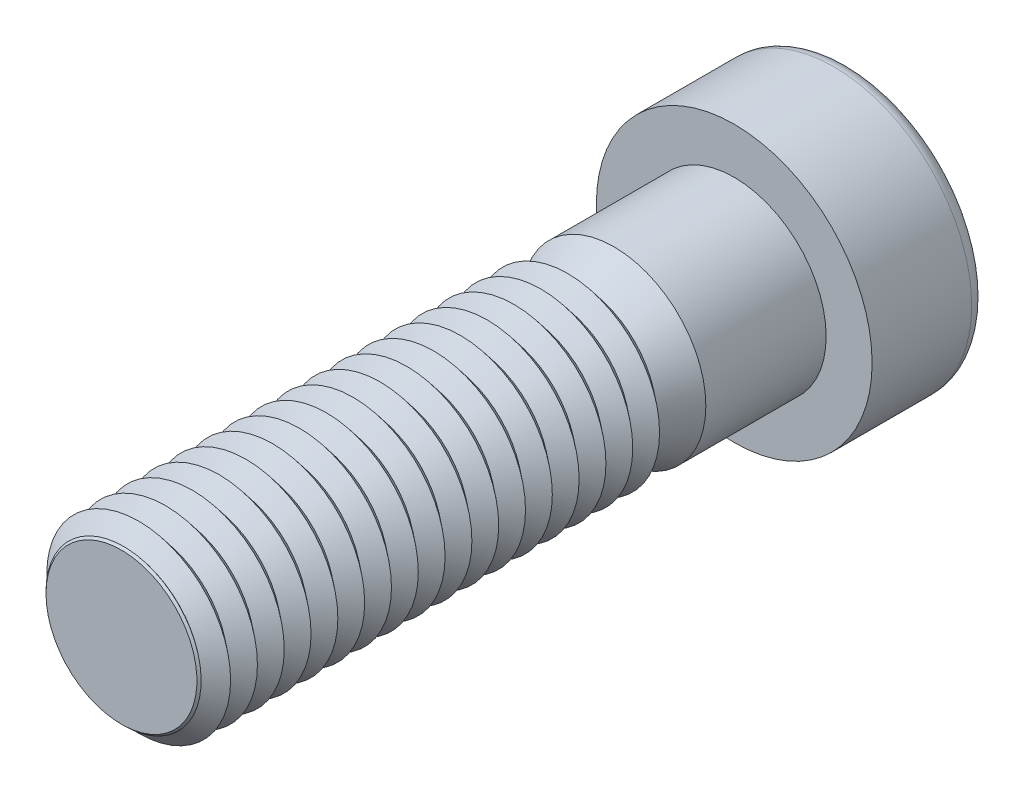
ISO-10303-21;
HEADER;
FILE_DESCRIPTION(('STEP AP214'),'2;1');
FILE_NAME('part.step','',(''),(''),'','','');
FILE_SCHEMA(('AUTOMOTIVE_DESIGN { 1 0 10303 214 1 1 1 1 }'));
ENDSEC;
DATA;
#1=APPLICATION_CONTEXT('core data for automotive mechanical design processes');
#2=APPLICATION_PROTOCOL_DEFINITION('international standard','automotive_design',2000,#1);
#3=PRODUCT_CONTEXT('',#1,'mechanical');
#4=PRODUCT('Part','Part','',(#3));
#5=PRODUCT_RELATED_PRODUCT_CATEGORY('part','',(#4));
#6=PRODUCT_DEFINITION_FORMATION('','',#4);
#7=PRODUCT_DEFINITION_CONTEXT('part definition',#1,'design');
#8=PRODUCT_DEFINITION('design','',#6,#7);
#9=PRODUCT_DEFINITION_SHAPE('','',#8);
#10=(LENGTH_UNIT() NAMED_UNIT(*) SI_UNIT(.MILLI.,.METRE.));
#11=(NAMED_UNIT(*) PLANE_ANGLE_UNIT() SI_UNIT($,.RADIAN.));
#12=(NAMED_UNIT(*) SI_UNIT($,.STERADIAN.) SOLID_ANGLE_UNIT());
#13=UNCERTAINTY_MEASURE_WITH_UNIT(LENGTH_MEASURE(1.E-05),#10,'distance_accuracy_value','');
#14=(GEOMETRIC_REPRESENTATION_CONTEXT(3) GLOBAL_UNCERTAINTY_ASSIGNED_CONTEXT((#13)) GLOBAL_UNIT_ASSIGNED_CONTEXT((#10,
#11,#12)) REPRESENTATION_CONTEXT('',''));
#15=CARTESIAN_POINT('',(0.,0.,0.));
#16=DIRECTION('',(0.,0.,1.));
#17=DIRECTION('',(1.,0.,0.));
#18=AXIS2_PLACEMENT_3D('',#15,#16,#17);
#19=CARTESIAN_POINT('',(73.9999999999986,39.9632500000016,19.9999999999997));
#20=DIRECTION('',(0.,0.,1.));
#21=DIRECTION('',(1.,0.,0.));
#22=AXIS2_PLACEMENT_3D('',#19,#20,#21);
#23=PLANE('',#22);
#24=CARTESIAN_POINT('',(73.9999999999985,37.5000000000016,20.0000000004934));
#25=DIRECTION('',(0.,0.,-1.));
#26=DIRECTION('',(-1.,0.,0.));
#27=AXIS2_PLACEMENT_3D('',#24,#25,#26);
#28=CIRCLE('',#27,4.92650000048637);
#29=CARTESIAN_POINT('',(69.0734999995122,37.5000000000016,20.0000000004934));
#30=VERTEX_POINT('',#29);
#31=EDGE_CURVE('E19',#30,#30,#28,.T.);
#32=ORIENTED_EDGE('',*,*,#31,.F.);
#33=EDGE_LOOP('',(#32));
#34=FACE_BOUND('',#33,.T.);
#35=ADVANCED_FACE('F16',(#34),#23,.T.);
#36=CARTESIAN_POINT('',(73.9999999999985,37.5000000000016,19.8622658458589));
#37=DIRECTION('',(0.,0.,-1.));
#38=DIRECTION('',(-1.,0.,0.));
#39=AXIS2_PLACEMENT_3D('',#36,#37,#38);
#40=CONICAL_SURFACE('',#39,5.06423415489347,0.785398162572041);
#41=ORIENTED_EDGE('',*,*,#31,.T.);
#42=EDGE_LOOP('',(#41));
#43=FACE_BOUND('',#42,.T.);
#44=CARTESIAN_POINT('',(73.9999999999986,37.5000000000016,19.8622658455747));
#45=DIRECTION('',(0.,0.,1.));
#46=DIRECTION('',(0.,-1.,0.));
#47=AXIS2_PLACEMENT_3D('',#44,#45,#46);
#48=CIRCLE('',#47,5.06423415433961);
#49=CARTESIAN_POINT('',(73.9999999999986,32.435765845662,19.8622658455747));
#50=VERTEX_POINT('',#49);
#51=EDGE_CURVE('E270',#50,#50,#48,.F.);
#52=ORIENTED_EDGE('',*,*,#51,.F.);
#53=EDGE_LOOP('',(#52));
#54=FACE_BOUND('',#53,.T.);
#55=ADVANCED_FACE('F759',(#43,#54),#40,.T.);
#56=CARTESIAN_POINT('',(73.9999999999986,37.5000000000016,19.862265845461));
#57=DIRECTION('',(0.,0.,1.));
#58=DIRECTION('',(1.,0.,0.));
#59=AXIS2_PLACEMENT_3D('',#56,#57,#58);
#60=CONICAL_SURFACE('',#59,5.06423415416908,0.88692115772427);
#61=CARTESIAN_POINT('',(73.9999999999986,37.5000000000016,19.7500000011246));
#62=DIRECTION('',(0.,0.,-1.));
#63=DIRECTION('',(0.,-1.,0.));
#64=AXIS2_PLACEMENT_3D('',#61,#62,#63);
#65=CIRCLE('',#64,4.92650000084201);
#66=CARTESIAN_POINT('',(73.9999999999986,32.5734999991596,19.7500000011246));
#67=VERTEX_POINT('',#66);
#68=EDGE_CURVE('E265',#67,#67,#65,.T.);
#69=ORIENTED_EDGE('',*,*,#68,.F.);
#70=EDGE_LOOP('',(#69));
#71=FACE_BOUND('',#70,.T.);
#72=ORIENTED_EDGE('',*,*,#51,.T.);
#73=EDGE_LOOP('',(#72));
#74=FACE_BOUND('',#73,.T.);
#75=ADVANCED_FACE('F751',(#71,#74),#60,.T.);
#76=CARTESIAN_POINT('',(73.9999999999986,37.5000000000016,18.87499999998));
#77=DIRECTION('',(0.,0.,-1.));
#78=DIRECTION('',(-1.,0.,0.));
#79=AXIS2_PLACEMENT_3D('',#76,#77,#78);
#80=CONICAL_SURFACE('',#79,6.00000000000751,0.886921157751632);
#81=CARTESIAN_POINT('',(73.9999999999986,37.5000000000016,18.87500000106));
#82=DIRECTION('',(0.,0.,1.));
#83=DIRECTION('',(0.,-1.,0.));
#84=AXIS2_PLACEMENT_3D('',#81,#82,#83);
#85=CIRCLE('',#84,5.99999999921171);
#86=CARTESIAN_POINT('',(73.9999999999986,31.5000000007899,18.87500000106));
#87=VERTEX_POINT('',#86);
#88=EDGE_CURVE('E260',#87,#87,#85,.F.);
#89=ORIENTED_EDGE('',*,*,#88,.F.);
#90=EDGE_LOOP('',(#89));
#91=FACE_BOUND('',#90,.T.);
#92=ORIENTED_EDGE('',*,*,#68,.T.);
#93=EDGE_LOOP('',(#92));
#94=FACE_BOUND('',#93,.T.);
#95=ADVANCED_FACE('F743',(#91,#94),#80,.T.);
#96=CARTESIAN_POINT('',(73.9999999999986,37.5000000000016,18.8750000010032));
#97=DIRECTION('',(0.,0.,1.));
#98=DIRECTION('',(0.,-1.,0.));
#99=AXIS2_PLACEMENT_3D('',#96,#97,#98);
#100=CONICAL_SURFACE('',#99,5.99999999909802,0.886921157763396);
#101=CARTESIAN_POINT('',(73.9999999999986,37.5000000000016,18.0000000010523));
#102=DIRECTION('',(0.,0.,-1.));
#103=DIRECTION('',(0.,-1.,0.));
#104=AXIS2_PLACEMENT_3D('',#101,#102,#103);
#105=CIRCLE('',#104,4.92650000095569);
#106=CARTESIAN_POINT('',(73.9999999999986,32.5734999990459,18.0000000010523));
#107=VERTEX_POINT('',#106);
#108=EDGE_CURVE('E255',#107,#107,#105,.T.);
#109=ORIENTED_EDGE('',*,*,#108,.F.);
#110=EDGE_LOOP('',(#109));
#111=FACE_BOUND('',#110,.T.);
#112=ORIENTED_EDGE('',*,*,#88,.T.);
#113=EDGE_LOOP('',(#112));
#114=FACE_BOUND('',#113,.T.);
#115=ADVANCED_FACE('F735',(#111,#114),#100,.T.);
#116=CARTESIAN_POINT('',(73.9999999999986,37.5000000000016,17.1250000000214));
#117=DIRECTION('',(0.,0.,-1.));
#118=DIRECTION('',(-1.,0.,0.));
#119=AXIS2_PLACEMENT_3D('',#116,#117,#118);
#120=CONICAL_SURFACE('',#119,6.00000000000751,0.886921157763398);
#121=CARTESIAN_POINT('',(73.9999999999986,37.5000000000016,17.1250000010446));
#122=DIRECTION('',(0.,0.,1.));
#123=DIRECTION('',(0.,-1.,0.));
#124=AXIS2_PLACEMENT_3D('',#121,#122,#123);
#125=CIRCLE('',#124,5.99999999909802);
#126=CARTESIAN_POINT('',(73.9999999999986,31.5000000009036,17.1250000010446));
#127=VERTEX_POINT('',#126);
#128=EDGE_CURVE('E250',#127,#127,#125,.F.);
#129=ORIENTED_EDGE('',*,*,#128,.F.);
#130=EDGE_LOOP('',(#129));
#131=FACE_BOUND('',#130,.T.);
#132=ORIENTED_EDGE('',*,*,#108,.T.);
#133=EDGE_LOOP('',(#132));
#134=FACE_BOUND('',#133,.T.);
#135=ADVANCED_FACE('F727',(#131,#134),#120,.T.);
#136=CARTESIAN_POINT('',(73.9999999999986,37.5000000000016,17.1250000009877));
#137=DIRECTION('',(0.,0.,1.));
#138=DIRECTION('',(0.,-1.,0.));
#139=AXIS2_PLACEMENT_3D('',#136,#137,#138);
#140=CONICAL_SURFACE('',#139,5.99999999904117,0.886921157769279);
#141=CARTESIAN_POINT('',(73.9999999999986,37.5000000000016,16.2500000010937));
#142=DIRECTION('',(0.,0.,-1.));
#143=DIRECTION('',(0.,-1.,0.));
#144=AXIS2_PLACEMENT_3D('',#141,#142,#143);
#145=CIRCLE('',#144,4.92650000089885);
#146=CARTESIAN_POINT('',(73.9999999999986,32.5734999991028,16.2500000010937));
#147=VERTEX_POINT('',#146);
#148=EDGE_CURVE('E245',#147,#147,#145,.T.);
#149=ORIENTED_EDGE('',*,*,#148,.F.);
#150=EDGE_LOOP('',(#149));
#151=FACE_BOUND('',#150,.T.);
#152=ORIENTED_EDGE('',*,*,#128,.T.);
#153=EDGE_LOOP('',(#152));
#154=FACE_BOUND('',#153,.T.);
#155=ADVANCED_FACE('F719',(#151,#154),#140,.T.);
#156=CARTESIAN_POINT('',(73.9999999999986,37.5000000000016,15.3750000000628));
#157=DIRECTION('',(0.,0.,-1.));
#158=DIRECTION('',(-1.,0.,0.));
#159=AXIS2_PLACEMENT_3D('',#156,#157,#158);
#160=CONICAL_SURFACE('',#159,5.99999999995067,0.886921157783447);
#161=CARTESIAN_POINT('',(73.9999999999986,37.5000000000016,15.3750000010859));
#162=DIRECTION('',(0.,0.,1.));
#163=DIRECTION('',(0.,-1.,0.));
#164=AXIS2_PLACEMENT_3D('',#161,#162,#163);
#165=CIRCLE('',#164,5.99999999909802);
#166=CARTESIAN_POINT('',(73.9999999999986,31.5000000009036,15.3750000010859));
#167=VERTEX_POINT('',#166);
#168=EDGE_CURVE('E240',#167,#167,#165,.F.);
#169=ORIENTED_EDGE('',*,*,#168,.F.);
#170=EDGE_LOOP('',(#169));
#171=FACE_BOUND('',#170,.T.);
#172=ORIENTED_EDGE('',*,*,#148,.T.);
#173=EDGE_LOOP('',(#172));
#174=FACE_BOUND('',#173,.T.);
#175=ADVANCED_FACE('F711',(#171,#174),#160,.T.);
#176=CARTESIAN_POINT('',(73.9999999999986,37.5000000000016,15.3750000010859));
#177=DIRECTION('',(0.,0.,1.));
#178=DIRECTION('',(1.,0.,0.));
#179=AXIS2_PLACEMENT_3D('',#176,#177,#178);
#180=CONICAL_SURFACE('',#179,5.99999999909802,0.88692115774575);
#181=CARTESIAN_POINT('',(73.9999999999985,37.5000000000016,14.500000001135));
#182=DIRECTION('',(0.,0.,-1.));
#183=DIRECTION('',(0.,-1.,0.));
#184=AXIS2_PLACEMENT_3D('',#181,#182,#183);
#185=CIRCLE('',#184,4.92650000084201);
#186=CARTESIAN_POINT('',(73.9999999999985,32.5734999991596,14.500000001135));
#187=VERTEX_POINT('',#186);
#188=EDGE_CURVE('E235',#187,#187,#185,.T.);
#189=ORIENTED_EDGE('',*,*,#188,.F.);
#190=EDGE_LOOP('',(#189));
#191=FACE_BOUND('',#190,.T.);
#192=ORIENTED_EDGE('',*,*,#168,.T.);
#193=EDGE_LOOP('',(#192));
#194=FACE_BOUND('',#193,.T.);
#195=ADVANCED_FACE('F703',(#191,#194),#180,.T.);
#196=CARTESIAN_POINT('',(73.9999999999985,37.5000000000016,13.6249999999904));
#197=DIRECTION('',(0.,0.,-1.));
#198=DIRECTION('',(0.,1.,0.));
#199=AXIS2_PLACEMENT_3D('',#196,#197,#198);
#200=CONICAL_SURFACE('',#199,6.00000000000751,0.886921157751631);
#201=CARTESIAN_POINT('',(73.9999999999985,37.5000000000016,13.6250000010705));
#202=DIRECTION('',(0.,0.,1.));
#203=DIRECTION('',(0.,-1.,0.));
#204=AXIS2_PLACEMENT_3D('',#201,#202,#203);
#205=CIRCLE('',#204,5.99999999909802);
#206=CARTESIAN_POINT('',(73.9999999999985,31.5000000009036,13.6250000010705));
#207=VERTEX_POINT('',#206);
#208=EDGE_CURVE('E230',#207,#207,#205,.F.);
#209=ORIENTED_EDGE('',*,*,#208,.F.);
#210=EDGE_LOOP('',(#209));
#211=FACE_BOUND('',#210,.T.);
#212=ORIENTED_EDGE('',*,*,#188,.T.);
#213=EDGE_LOOP('',(#212));
#214=FACE_BOUND('',#213,.T.);
#215=ADVANCED_FACE('F695',(#211,#214),#200,.T.);
#216=CARTESIAN_POINT('',(73.9999999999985,37.5000000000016,13.6250000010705));
#217=DIRECTION('',(0.,0.,1.));
#218=DIRECTION('',(1.,0.,0.));
#219=AXIS2_PLACEMENT_3D('',#216,#217,#218);
#220=CONICAL_SURFACE('',#219,5.99999999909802,0.886921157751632);
#221=CARTESIAN_POINT('',(73.9999999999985,37.5000000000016,12.7500000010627));
#222=DIRECTION('',(0.,0.,-1.));
#223=DIRECTION('',(0.,-1.,0.));
#224=AXIS2_PLACEMENT_3D('',#221,#222,#223);
#225=CIRCLE('',#224,4.92650000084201);
#226=CARTESIAN_POINT('',(73.9999999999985,32.5734999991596,12.7500000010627));
#227=VERTEX_POINT('',#226);
#228=EDGE_CURVE('E225',#227,#227,#225,.T.);
#229=ORIENTED_EDGE('',*,*,#228,.F.);
#230=EDGE_LOOP('',(#229));
#231=FACE_BOUND('',#230,.T.);
#232=ORIENTED_EDGE('',*,*,#208,.T.);
#233=EDGE_LOOP('',(#232));
#234=FACE_BOUND('',#233,.T.);
#235=ADVANCED_FACE('F687',(#231,#234),#220,.T.);
#236=CARTESIAN_POINT('',(73.9999999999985,37.5000000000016,11.8749999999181));
#237=DIRECTION('',(0.,0.,-1.));
#238=DIRECTION('',(-1.,0.,0.));
#239=AXIS2_PLACEMENT_3D('',#236,#237,#238);
#240=CONICAL_SURFACE('',#239,6.00000000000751,0.88692115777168);
#241=CARTESIAN_POINT('',(73.9999999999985,37.5000000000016,11.875000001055));
#242=DIRECTION('',(0.,0.,1.));
#243=DIRECTION('',(0.,-1.,0.));
#244=AXIS2_PLACEMENT_3D('',#241,#242,#243);
#245=CIRCLE('',#244,5.99999999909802);
#246=CARTESIAN_POINT('',(73.9999999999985,31.5000000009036,11.875000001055));
#247=VERTEX_POINT('',#246);
#248=EDGE_CURVE('E220',#247,#247,#245,.F.);
#249=ORIENTED_EDGE('',*,*,#248,.F.);
#250=EDGE_LOOP('',(#249));
#251=FACE_BOUND('',#250,.T.);
#252=ORIENTED_EDGE('',*,*,#228,.T.);
#253=EDGE_LOOP('',(#252));
#254=FACE_BOUND('',#253,.T.);
#255=ADVANCED_FACE('F679',(#251,#254),#240,.T.);
#256=CARTESIAN_POINT('',(73.9999999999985,37.5000000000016,11.8750000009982));
#257=DIRECTION('',(0.,0.,1.));
#258=DIRECTION('',(1.,0.,0.));
#259=AXIS2_PLACEMENT_3D('',#256,#257,#258);
#260=CONICAL_SURFACE('',#259,5.99999999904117,0.886921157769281);
#261=CARTESIAN_POINT('',(73.9999999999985,37.5000000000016,11.0000000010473));
#262=DIRECTION('',(0.,0.,-1.));
#263=DIRECTION('',(0.,-1.,0.));
#264=AXIS2_PLACEMENT_3D('',#261,#262,#263);
#265=CIRCLE('',#264,4.92650000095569);
#266=CARTESIAN_POINT('',(73.9999999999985,32.5734999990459,11.0000000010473));
#267=VERTEX_POINT('',#266);
#268=EDGE_CURVE('E215',#267,#267,#265,.T.);
#269=ORIENTED_EDGE('',*,*,#268,.F.);
#270=EDGE_LOOP('',(#269));
#271=FACE_BOUND('',#270,.T.);
#272=ORIENTED_EDGE('',*,*,#248,.T.);
#273=EDGE_LOOP('',(#272));
#274=FACE_BOUND('',#273,.T.);
#275=ADVANCED_FACE('F671',(#271,#274),#260,.T.);
#276=CARTESIAN_POINT('',(73.9999999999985,37.5000000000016,10.1250000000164));
#277=DIRECTION('',(0.,0.,-1.));
#278=DIRECTION('',(-1.,0.,0.));
#279=AXIS2_PLACEMENT_3D('',#276,#277,#278);
#280=CONICAL_SURFACE('',#279,6.00000000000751,0.886921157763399);
#281=CARTESIAN_POINT('',(73.9999999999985,37.5000000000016,10.1250000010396));
#282=DIRECTION('',(0.,0.,1.));
#283=DIRECTION('',(0.,-1.,0.));
#284=AXIS2_PLACEMENT_3D('',#281,#282,#283);
#285=CIRCLE('',#284,5.99999999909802);
#286=CARTESIAN_POINT('',(73.9999999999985,31.5000000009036,10.1250000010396));
#287=VERTEX_POINT('',#286);
#288=EDGE_CURVE('E210',#287,#287,#285,.F.);
#289=ORIENTED_EDGE('',*,*,#288,.F.);
#290=EDGE_LOOP('',(#289));
#291=FACE_BOUND('',#290,.T.);
#292=ORIENTED_EDGE('',*,*,#268,.T.);
#293=EDGE_LOOP('',(#292));
#294=FACE_BOUND('',#293,.T.);
#295=ADVANCED_FACE('F663',(#291,#294),#280,.T.);
#296=CARTESIAN_POINT('',(73.9999999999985,37.5000000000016,10.1250000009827));
#297=DIRECTION('',(0.,0.,1.));
#298=DIRECTION('',(1.,0.,0.));
#299=AXIS2_PLACEMENT_3D('',#296,#297,#298);
#300=CONICAL_SURFACE('',#299,5.99999999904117,0.886921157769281);
#301=CARTESIAN_POINT('',(73.9999999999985,37.5000000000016,9.25000000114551));
#302=DIRECTION('',(0.,0.,-1.));
#303=DIRECTION('',(0.,-1.,0.));
#304=AXIS2_PLACEMENT_3D('',#301,#302,#303);
#305=CIRCLE('',#304,4.92650000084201);
#306=CARTESIAN_POINT('',(73.9999999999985,32.5734999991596,9.25000000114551));
#307=VERTEX_POINT('',#306);
#308=EDGE_CURVE('E205',#307,#307,#305,.T.);
#309=ORIENTED_EDGE('',*,*,#308,.F.);
#310=EDGE_LOOP('',(#309));
#311=FACE_BOUND('',#310,.T.);
#312=ORIENTED_EDGE('',*,*,#288,.T.);
#313=EDGE_LOOP('',(#312));
#314=FACE_BOUND('',#313,.T.);
#315=ADVANCED_FACE('F655',(#311,#314),#300,.T.);
#316=CARTESIAN_POINT('',(73.9999999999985,37.5000000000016,8.37500000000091));
#317=DIRECTION('',(0.,0.,-1.));
#318=DIRECTION('',(-1.,0.,0.));
#319=AXIS2_PLACEMENT_3D('',#316,#317,#318);
#320=CONICAL_SURFACE('',#319,6.00000000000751,0.886921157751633);
#321=CARTESIAN_POINT('',(73.9999999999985,37.5000000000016,8.37500000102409));
#322=DIRECTION('',(0.,0.,1.));
#323=DIRECTION('',(0.,-1.,0.));
#324=AXIS2_PLACEMENT_3D('',#321,#322,#323);
#325=CIRCLE('',#324,5.99999999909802);
#326=CARTESIAN_POINT('',(73.9999999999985,31.5000000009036,8.37500000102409));
#327=VERTEX_POINT('',#326);
#328=EDGE_CURVE('E200',#327,#327,#325,.F.);
#329=ORIENTED_EDGE('',*,*,#328,.F.);
#330=EDGE_LOOP('',(#329));
#331=FACE_BOUND('',#330,.T.);
#332=ORIENTED_EDGE('',*,*,#308,.T.);
#333=EDGE_LOOP('',(#332));
#334=FACE_BOUND('',#333,.T.);
#335=ADVANCED_FACE('F647',(#331,#334),#320,.T.);
#336=CARTESIAN_POINT('',(73.9999999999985,37.5000000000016,8.37500000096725));
#337=DIRECTION('',(0.,0.,1.));
#338=DIRECTION('',(1.,0.,0.));
#339=AXIS2_PLACEMENT_3D('',#336,#337,#338);
#340=CONICAL_SURFACE('',#339,5.99999999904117,0.886921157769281);
#341=CARTESIAN_POINT('',(73.9999999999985,37.5000000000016,7.50000000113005));
#342=DIRECTION('',(0.,0.,-1.));
#343=DIRECTION('',(0.,-1.,0.));
#344=AXIS2_PLACEMENT_3D('',#341,#342,#343);
#345=CIRCLE('',#344,4.92650000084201);
#346=CARTESIAN_POINT('',(73.9999999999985,32.5734999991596,7.50000000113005));
#347=VERTEX_POINT('',#346);
#348=EDGE_CURVE('E195',#347,#347,#345,.T.);
#349=ORIENTED_EDGE('',*,*,#348,.F.);
#350=EDGE_LOOP('',(#349));
#351=FACE_BOUND('',#350,.T.);
#352=ORIENTED_EDGE('',*,*,#328,.T.);
#353=EDGE_LOOP('',(#352));
#354=FACE_BOUND('',#353,.T.);
#355=ADVANCED_FACE('F639',(#351,#354),#340,.T.);
#356=CARTESIAN_POINT('',(73.9999999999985,37.5000000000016,6.62499999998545));
#357=DIRECTION('',(0.,0.,-1.));
#358=DIRECTION('',(-1.,0.,0.));
#359=AXIS2_PLACEMENT_3D('',#356,#357,#358);
#360=CONICAL_SURFACE('',#359,6.00000000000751,0.886921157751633);
#361=CARTESIAN_POINT('',(73.9999999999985,37.5000000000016,6.62500000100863));
#362=DIRECTION('',(0.,0.,1.));
#363=DIRECTION('',(0.,-1.,0.));
#364=AXIS2_PLACEMENT_3D('',#361,#362,#363);
#365=CIRCLE('',#364,5.99999999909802);
#366=CARTESIAN_POINT('',(73.9999999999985,31.5000000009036,6.62500000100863));
#367=VERTEX_POINT('',#366);
#368=EDGE_CURVE('E190',#367,#367,#365,.F.);
#369=ORIENTED_EDGE('',*,*,#368,.F.);
#370=EDGE_LOOP('',(#369));
#371=FACE_BOUND('',#370,.T.);
#372=ORIENTED_EDGE('',*,*,#348,.T.);
#373=EDGE_LOOP('',(#372));
#374=FACE_BOUND('',#373,.T.);
#375=ADVANCED_FACE('F631',(#371,#374),#360,.T.);
#376=CARTESIAN_POINT('',(73.9999999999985,37.5000000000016,6.62500000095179));
#377=DIRECTION('',(0.,0.,1.));
#378=DIRECTION('',(1.,0.,0.));
#379=AXIS2_PLACEMENT_3D('',#376,#377,#378);
#380=CONICAL_SURFACE('',#379,5.99999999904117,0.886921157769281);
#381=CARTESIAN_POINT('',(73.9999999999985,37.5000000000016,5.75000000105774));
#382=DIRECTION('',(0.,0.,-1.));
#383=DIRECTION('',(0.,-1.,0.));
#384=AXIS2_PLACEMENT_3D('',#381,#382,#383);
#385=CIRCLE('',#384,4.92650000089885);
#386=CARTESIAN_POINT('',(73.9999999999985,32.5734999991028,5.75000000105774));
#387=VERTEX_POINT('',#386);
#388=EDGE_CURVE('E185',#387,#387,#385,.T.);
#389=ORIENTED_EDGE('',*,*,#388,.F.);
#390=EDGE_LOOP('',(#389));
#391=FACE_BOUND('',#390,.T.);
#392=ORIENTED_EDGE('',*,*,#368,.T.);
#393=EDGE_LOOP('',(#392));
#394=FACE_BOUND('',#393,.T.);
#395=ADVANCED_FACE('F623',(#391,#394),#380,.T.);
#396=CARTESIAN_POINT('',(73.9999999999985,37.5000000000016,4.87500000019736));
#397=DIRECTION('',(0.,0.,-1.));
#398=DIRECTION('',(-1.,0.,0.));
#399=AXIS2_PLACEMENT_3D('',#396,#397,#398);
#400=CONICAL_SURFACE('',#399,5.9999999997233,0.886921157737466);
#401=CARTESIAN_POINT('',(73.9999999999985,37.5000000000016,4.87500000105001));
#402=DIRECTION('',(0.,0.,1.));
#403=DIRECTION('',(0.,-1.,0.));
#404=AXIS2_PLACEMENT_3D('',#401,#402,#403);
#405=CIRCLE('',#404,5.99999999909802);
#406=CARTESIAN_POINT('',(73.9999999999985,31.5000000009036,4.87500000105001));
#407=VERTEX_POINT('',#406);
#408=EDGE_CURVE('E180',#407,#407,#405,.F.);
#409=ORIENTED_EDGE('',*,*,#408,.F.);
#410=EDGE_LOOP('',(#409));
#411=FACE_BOUND('',#410,.T.);
#412=ORIENTED_EDGE('',*,*,#388,.T.);
#413=EDGE_LOOP('',(#412));
#414=FACE_BOUND('',#413,.T.);
#415=ADVANCED_FACE('F615',(#411,#414),#400,.T.);
#416=CARTESIAN_POINT('',(73.9999999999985,37.5000000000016,4.87500000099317));
#417=DIRECTION('',(0.,0.,1.));
#418=DIRECTION('',(1.,0.,0.));
#419=AXIS2_PLACEMENT_3D('',#416,#417,#418);
#420=CONICAL_SURFACE('',#419,5.99999999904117,0.886921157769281);
#421=CARTESIAN_POINT('',(73.9999999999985,37.5000000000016,4.00000000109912));
#422=DIRECTION('',(0.,0.,-1.));
#423=DIRECTION('',(0.,-1.,0.));
#424=AXIS2_PLACEMENT_3D('',#421,#422,#423);
#425=CIRCLE('',#424,4.92650000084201);
#426=CARTESIAN_POINT('',(73.9999999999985,32.5734999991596,4.00000000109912));
#427=VERTEX_POINT('',#426);
#428=EDGE_CURVE('E175',#427,#427,#425,.T.);
#429=ORIENTED_EDGE('',*,*,#428,.F.);
#430=EDGE_LOOP('',(#429));
#431=FACE_BOUND('',#430,.T.);
#432=ORIENTED_EDGE('',*,*,#408,.T.);
#433=EDGE_LOOP('',(#432));
#434=FACE_BOUND('',#433,.T.);
#435=ADVANCED_FACE('F607',(#431,#434),#420,.T.);
#436=CARTESIAN_POINT('',(73.9999999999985,37.5000000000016,3.12499999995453));
#437=DIRECTION('',(0.,0.,-1.));
#438=DIRECTION('',(-1.,0.,0.));
#439=AXIS2_PLACEMENT_3D('',#436,#437,#438);
#440=CONICAL_SURFACE('',#439,6.00000000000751,0.886921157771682);
#441=CARTESIAN_POINT('',(73.9999999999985,37.5000000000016,3.12500000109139));
#442=DIRECTION('',(0.,0.,1.));
#443=DIRECTION('',(0.,-1.,0.));
#444=AXIS2_PLACEMENT_3D('',#441,#442,#443);
#445=CIRCLE('',#444,5.99999999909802);
#446=CARTESIAN_POINT('',(73.9999999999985,31.5000000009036,3.12500000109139));
#447=VERTEX_POINT('',#446);
#448=EDGE_CURVE('E170',#447,#447,#445,.F.);
#449=ORIENTED_EDGE('',*,*,#448,.F.);
#450=EDGE_LOOP('',(#449));
#451=FACE_BOUND('',#450,.T.);
#452=ORIENTED_EDGE('',*,*,#428,.T.);
#453=EDGE_LOOP('',(#452));
#454=FACE_BOUND('',#453,.T.);
#455=ADVANCED_FACE('F599',(#451,#454),#440,.T.);
#456=CARTESIAN_POINT('',(73.9999999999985,37.5000000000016,3.12500000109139));
#457=DIRECTION('',(0.,0.,1.));
#458=DIRECTION('',(1.,0.,0.));
#459=AXIS2_PLACEMENT_3D('',#456,#457,#458);
#460=CONICAL_SURFACE('',#459,5.99999999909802,0.886921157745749);
#461=CARTESIAN_POINT('',(73.9999999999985,37.5000000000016,2.25000000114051));
#462=DIRECTION('',(0.,0.,-1.));
#463=DIRECTION('',(0.,-1.,0.));
#464=AXIS2_PLACEMENT_3D('',#461,#462,#463);
#465=CIRCLE('',#464,4.92650000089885);
#466=CARTESIAN_POINT('',(73.9999999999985,32.5734999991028,2.25000000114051));
#467=VERTEX_POINT('',#466);
#468=EDGE_CURVE('E165',#467,#467,#465,.T.);
#469=ORIENTED_EDGE('',*,*,#468,.F.);
#470=EDGE_LOOP('',(#469));
#471=FACE_BOUND('',#470,.T.);
#472=ORIENTED_EDGE('',*,*,#448,.T.);
#473=EDGE_LOOP('',(#472));
#474=FACE_BOUND('',#473,.T.);
#475=ADVANCED_FACE('F591',(#471,#474),#460,.T.);
#476=CARTESIAN_POINT('',(73.9999999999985,37.5000000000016,1.37499999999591));
#477=DIRECTION('',(0.,0.,-1.));
#478=DIRECTION('',(-1.,0.,0.));
#479=AXIS2_PLACEMENT_3D('',#476,#477,#478);
#480=CONICAL_SURFACE('',#479,6.00000000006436,0.886921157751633);
#481=CARTESIAN_POINT('',(73.9999999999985,37.5000000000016,1.37500000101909));
#482=DIRECTION('',(0.,0.,1.));
#483=DIRECTION('',(0.,-1.,0.));
#484=AXIS2_PLACEMENT_3D('',#481,#482,#483);
#485=CIRCLE('',#484,5.99999999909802);
#486=CARTESIAN_POINT('',(73.9999999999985,31.5000000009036,1.37500000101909));
#487=VERTEX_POINT('',#486);
#488=EDGE_CURVE('E160',#487,#487,#485,.F.);
#489=ORIENTED_EDGE('',*,*,#488,.F.);
#490=EDGE_LOOP('',(#489));
#491=FACE_BOUND('',#490,.T.);
#492=ORIENTED_EDGE('',*,*,#468,.T.);
#493=EDGE_LOOP('',(#492));
#494=FACE_BOUND('',#493,.T.);
#495=ADVANCED_FACE('F583',(#491,#494),#480,.T.);
#496=CARTESIAN_POINT('',(73.9999999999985,37.5000000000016,1.37500000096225));
#497=DIRECTION('',(0.,0.,1.));
#498=DIRECTION('',(1.,0.,0.));
#499=AXIS2_PLACEMENT_3D('',#496,#497,#498);
#500=CONICAL_SURFACE('',#499,5.99999999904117,0.886921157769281);
#501=CARTESIAN_POINT('',(73.9999999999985,37.5000000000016,0.500000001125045));
#502=DIRECTION('',(0.,0.,-1.));
#503=DIRECTION('',(0.,-1.,0.));
#504=AXIS2_PLACEMENT_3D('',#501,#502,#503);
#505=CIRCLE('',#504,4.92650000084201);
#506=CARTESIAN_POINT('',(73.9999999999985,32.5734999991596,0.500000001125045));
#507=VERTEX_POINT('',#506);
#508=EDGE_CURVE('E155',#507,#507,#505,.T.);
#509=ORIENTED_EDGE('',*,*,#508,.F.);
#510=EDGE_LOOP('',(#509));
#511=FACE_BOUND('',#510,.T.);
#512=ORIENTED_EDGE('',*,*,#488,.T.);
#513=EDGE_LOOP('',(#512));
#514=FACE_BOUND('',#513,.T.);
#515=ADVANCED_FACE('F575',(#511,#514),#500,.T.);
#516=CARTESIAN_POINT('',(73.9999999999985,37.5000000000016,-0.375000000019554));
#517=DIRECTION('',(0.,0.,-1.));
#518=DIRECTION('',(-1.,0.,0.));
#519=AXIS2_PLACEMENT_3D('',#516,#517,#518);
#520=CONICAL_SURFACE('',#519,6.00000000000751,0.886921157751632);
#521=CARTESIAN_POINT('',(73.9999999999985,37.5000000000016,-0.374999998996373));
#522=DIRECTION('',(0.,0.,1.));
#523=DIRECTION('',(0.,-1.,0.));
#524=AXIS2_PLACEMENT_3D('',#521,#522,#523);
#525=CIRCLE('',#524,5.99999999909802);
#526=CARTESIAN_POINT('',(73.9999999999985,31.5000000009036,-0.374999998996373));
#527=VERTEX_POINT('',#526);
#528=EDGE_CURVE('E150',#527,#527,#525,.F.);
#529=ORIENTED_EDGE('',*,*,#528,.F.);
#530=EDGE_LOOP('',(#529));
#531=FACE_BOUND('',#530,.T.);
#532=ORIENTED_EDGE('',*,*,#508,.T.);
#533=EDGE_LOOP('',(#532));
#534=FACE_BOUND('',#533,.T.);
#535=ADVANCED_FACE('F567',(#531,#534),#520,.T.);
#536=CARTESIAN_POINT('',(73.9999999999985,37.5000000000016,-0.374999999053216));
#537=DIRECTION('',(0.,0.,1.));
#538=DIRECTION('',(1.,0.,0.));
#539=AXIS2_PLACEMENT_3D('',#536,#537,#538);
#540=CONICAL_SURFACE('',#539,5.99999999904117,0.886921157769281);
#541=CARTESIAN_POINT('',(73.9999999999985,37.5000000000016,-1.24999999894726));
#542=DIRECTION('',(0.,0.,-1.));
#543=DIRECTION('',(0.,-1.,0.));
#544=AXIS2_PLACEMENT_3D('',#541,#542,#543);
#545=CIRCLE('',#544,4.92650000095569);
#546=CARTESIAN_POINT('',(73.9999999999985,32.5734999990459,-1.24999999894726));
#547=VERTEX_POINT('',#546);
#548=EDGE_CURVE('E145',#547,#547,#545,.T.);
#549=ORIENTED_EDGE('',*,*,#548,.F.);
#550=EDGE_LOOP('',(#549));
#551=FACE_BOUND('',#550,.T.);
#552=ORIENTED_EDGE('',*,*,#528,.T.);
#553=EDGE_LOOP('',(#552));
#554=FACE_BOUND('',#553,.T.);
#555=ADVANCED_FACE('F559',(#551,#554),#540,.T.);
#556=CARTESIAN_POINT('',(73.9999999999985,37.5000000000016,-2.12499999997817));
#557=DIRECTION('',(0.,0.,-1.));
#558=DIRECTION('',(-1.,0.,0.));
#559=AXIS2_PLACEMENT_3D('',#556,#557,#558);
#560=CONICAL_SURFACE('',#559,6.00000000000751,0.886921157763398);
#561=CARTESIAN_POINT('',(73.9999999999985,37.5000000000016,-2.12499999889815));
#562=DIRECTION('',(0.,0.,1.));
#563=DIRECTION('',(0.,-1.,0.));
#564=AXIS2_PLACEMENT_3D('',#561,#562,#563);
#565=CIRCLE('',#564,5.99999999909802);
#566=CARTESIAN_POINT('',(73.9999999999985,31.5000000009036,-2.12499999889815));
#567=VERTEX_POINT('',#566);
#568=EDGE_CURVE('E140',#567,#567,#565,.F.);
#569=ORIENTED_EDGE('',*,*,#568,.F.);
#570=EDGE_LOOP('',(#569));
#571=FACE_BOUND('',#570,.T.);
#572=ORIENTED_EDGE('',*,*,#548,.T.);
#573=EDGE_LOOP('',(#572));
#574=FACE_BOUND('',#573,.T.);
#575=ADVANCED_FACE('F551',(#571,#574),#560,.T.);
#576=CARTESIAN_POINT('',(73.9999999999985,37.5000000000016,-2.12499999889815));
#577=DIRECTION('',(0.,0.,1.));
#578=DIRECTION('',(1.,0.,0.));
#579=AXIS2_PLACEMENT_3D('',#576,#577,#578);
#580=CONICAL_SURFACE('',#579,5.99999999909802,0.88692115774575);
#581=CARTESIAN_POINT('',(73.9999999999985,37.5000000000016,-2.99999999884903));
#582=DIRECTION('',(0.,0.,-1.));
#583=DIRECTION('',(0.,-1.,0.));
#584=AXIS2_PLACEMENT_3D('',#581,#582,#583);
#585=CIRCLE('',#584,4.92650000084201);
#586=CARTESIAN_POINT('',(73.9999999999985,32.5734999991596,-2.99999999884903));
#587=VERTEX_POINT('',#586);
#588=EDGE_CURVE('E135',#587,#587,#585,.T.);
#589=ORIENTED_EDGE('',*,*,#588,.F.);
#590=EDGE_LOOP('',(#589));
#591=FACE_BOUND('',#590,.T.);
#592=ORIENTED_EDGE('',*,*,#568,.T.);
#593=EDGE_LOOP('',(#592));
#594=FACE_BOUND('',#593,.T.);
#595=ADVANCED_FACE('F543',(#591,#594),#580,.T.);
#596=CARTESIAN_POINT('',(73.9999999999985,37.5000000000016,-3.87499999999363));
#597=DIRECTION('',(0.,0.,-1.));
#598=DIRECTION('',(-1.,0.,0.));
#599=AXIS2_PLACEMENT_3D('',#596,#597,#598);
#600=CONICAL_SURFACE('',#599,6.00000000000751,0.886921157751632);
#601=CARTESIAN_POINT('',(73.9999999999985,37.5000000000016,-3.87499999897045));
#602=DIRECTION('',(0.,0.,1.));
#603=DIRECTION('',(0.,-1.,0.));
#604=AXIS2_PLACEMENT_3D('',#601,#602,#603);
#605=CIRCLE('',#604,5.99999999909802);
#606=CARTESIAN_POINT('',(73.9999999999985,31.5000000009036,-3.87499999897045));
#607=VERTEX_POINT('',#606);
#608=EDGE_CURVE('E130',#607,#607,#605,.F.);
#609=ORIENTED_EDGE('',*,*,#608,.F.);
#610=EDGE_LOOP('',(#609));
#611=FACE_BOUND('',#610,.T.);
#612=ORIENTED_EDGE('',*,*,#588,.T.);
#613=EDGE_LOOP('',(#612));
#614=FACE_BOUND('',#613,.T.);
#615=ADVANCED_FACE('F535',(#611,#614),#600,.T.);
#616=CARTESIAN_POINT('',(73.9999999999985,37.5000000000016,-3.87499999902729));
#617=DIRECTION('',(0.,0.,1.));
#618=DIRECTION('',(0.,-1.,0.));
#619=AXIS2_PLACEMENT_3D('',#616,#617,#618);
#620=CONICAL_SURFACE('',#619,5.99999999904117,0.886921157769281);
#621=CARTESIAN_POINT('',(73.9999999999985,37.5000000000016,-4.7499999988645));
#622=DIRECTION('',(0.,0.,-1.));
#623=DIRECTION('',(0.,-1.,0.));
#624=AXIS2_PLACEMENT_3D('',#621,#622,#623);
#625=CIRCLE('',#624,4.92650000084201);
#626=CARTESIAN_POINT('',(73.9999999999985,32.5734999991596,-4.7499999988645));
#627=VERTEX_POINT('',#626);
#628=EDGE_CURVE('E125',#627,#627,#625,.T.);
#629=ORIENTED_EDGE('',*,*,#628,.F.);
#630=EDGE_LOOP('',(#629));
#631=FACE_BOUND('',#630,.T.);
#632=ORIENTED_EDGE('',*,*,#608,.T.);
#633=EDGE_LOOP('',(#632));
#634=FACE_BOUND('',#633,.T.);
#635=ADVANCED_FACE('F527',(#631,#634),#620,.T.);
#636=CARTESIAN_POINT('',(73.9999999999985,37.5000000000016,-5.62500000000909));
#637=DIRECTION('',(0.,0.,-1.));
#638=DIRECTION('',(-1.,0.,0.));
#639=AXIS2_PLACEMENT_3D('',#636,#637,#638);
#640=CONICAL_SURFACE('',#639,6.00000000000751,0.886921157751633);
#641=CARTESIAN_POINT('',(73.9999999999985,37.5000000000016,-5.62499999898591));
#642=DIRECTION('',(0.,0.,1.));
#643=DIRECTION('',(0.,-1.,0.));
#644=AXIS2_PLACEMENT_3D('',#641,#642,#643);
#645=CIRCLE('',#644,5.99999999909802);
#646=CARTESIAN_POINT('',(73.9999999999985,31.5000000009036,-5.62499999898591));
#647=VERTEX_POINT('',#646);
#648=EDGE_CURVE('E120',#647,#647,#645,.F.);
#649=ORIENTED_EDGE('',*,*,#648,.F.);
#650=EDGE_LOOP('',(#649));
#651=FACE_BOUND('',#650,.T.);
#652=ORIENTED_EDGE('',*,*,#628,.T.);
#653=EDGE_LOOP('',(#652));
#654=FACE_BOUND('',#653,.T.);
#655=ADVANCED_FACE('F519',(#651,#654),#640,.T.);
#656=CARTESIAN_POINT('',(73.9999999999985,37.5000000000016,-5.62499999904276));
#657=DIRECTION('',(0.,0.,1.));
#658=DIRECTION('',(1.,0.,0.));
#659=AXIS2_PLACEMENT_3D('',#656,#657,#658);
#660=CONICAL_SURFACE('',#659,5.99999999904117,0.886921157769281);
#661=CARTESIAN_POINT('',(73.9999999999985,37.5000000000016,-6.49999999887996));
#662=DIRECTION('',(0.,0.,-1.));
#663=DIRECTION('',(0.,-1.,0.));
#664=AXIS2_PLACEMENT_3D('',#661,#662,#663);
#665=CIRCLE('',#664,4.92650000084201);
#666=CARTESIAN_POINT('',(73.9999999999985,32.5734999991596,-6.49999999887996));
#667=VERTEX_POINT('',#666);
#668=EDGE_CURVE('E115',#667,#667,#665,.T.);
#669=ORIENTED_EDGE('',*,*,#668,.F.);
#670=EDGE_LOOP('',(#669));
#671=FACE_BOUND('',#670,.T.);
#672=ORIENTED_EDGE('',*,*,#648,.T.);
#673=EDGE_LOOP('',(#672));
#674=FACE_BOUND('',#673,.T.);
#675=ADVANCED_FACE('F511',(#671,#674),#660,.T.);
#676=CARTESIAN_POINT('',(73.9999999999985,37.5000000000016,-7.37500000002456));
#677=DIRECTION('',(0.,0.,-1.));
#678=DIRECTION('',(-1.,0.,0.));
#679=AXIS2_PLACEMENT_3D('',#676,#677,#678);
#680=CONICAL_SURFACE('',#679,6.00000000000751,0.886921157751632);
#681=CARTESIAN_POINT('',(73.9999999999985,37.5000000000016,-7.37499999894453));
#682=DIRECTION('',(0.,0.,1.));
#683=DIRECTION('',(0.,-1.,0.));
#684=AXIS2_PLACEMENT_3D('',#681,#682,#683);
#685=CIRCLE('',#684,5.99999999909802);
#686=CARTESIAN_POINT('',(73.9999999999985,31.5000000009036,-7.37499999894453));
#687=VERTEX_POINT('',#686);
#688=EDGE_CURVE('E110',#687,#687,#685,.F.);
#689=ORIENTED_EDGE('',*,*,#688,.F.);
#690=EDGE_LOOP('',(#689));
#691=FACE_BOUND('',#690,.T.);
#692=ORIENTED_EDGE('',*,*,#668,.T.);
#693=EDGE_LOOP('',(#692));
#694=FACE_BOUND('',#693,.T.);
#695=ADVANCED_FACE('F503',(#691,#694),#680,.T.);
#696=CARTESIAN_POINT('',(73.9999999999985,37.5000000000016,-7.37499999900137));
#697=DIRECTION('',(0.,0.,1.));
#698=DIRECTION('',(0.,-1.,0.));
#699=AXIS2_PLACEMENT_3D('',#696,#697,#698);
#700=CONICAL_SURFACE('',#699,5.99999999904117,0.886921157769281);
#701=CARTESIAN_POINT('',(73.9999999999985,37.5000000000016,-8.24999999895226));
#702=DIRECTION('',(0.,0.,-1.));
#703=DIRECTION('',(0.,-1.,0.));
#704=AXIS2_PLACEMENT_3D('',#701,#702,#703);
#705=CIRCLE('',#704,4.92650000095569);
#706=CARTESIAN_POINT('',(73.9999999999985,32.5734999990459,-8.24999999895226));
#707=VERTEX_POINT('',#706);
#708=EDGE_CURVE('E107',#707,#707,#705,.T.);
#709=ORIENTED_EDGE('',*,*,#708,.F.);
#710=EDGE_LOOP('',(#709));
#711=FACE_BOUND('',#710,.T.);
#712=ORIENTED_EDGE('',*,*,#688,.T.);
#713=EDGE_LOOP('',(#712));
#714=FACE_BOUND('',#713,.T.);
#715=ADVANCED_FACE('F496',(#711,#714),#700,.T.);
#716=CARTESIAN_POINT('',(73.9999999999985,37.5000000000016,-19.5000000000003));
#717=DIRECTION('',(0.,0.,-1.));
#718=DIRECTION('',(-1.,0.,0.));
#719=AXIS2_PLACEMENT_3D('',#716,#717,#718);
#720=PLANE('',#719);
#721=CARTESIAN_POINT('',(73.9999999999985,37.5000000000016,-19.5000000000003));
#722=DIRECTION('',(0.,0.,1.));
#723=DIRECTION('',(1.,0.,0.));
#724=AXIS2_PLACEMENT_3D('',#721,#722,#723);
#725=CIRCLE('',#724,3.);
#726=CARTESIAN_POINT('',(76.9999999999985,37.5000000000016,-19.5000000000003));
#727=VERTEX_POINT('',#726);
#728=EDGE_CURVE('E104',#727,#727,#725,.F.);
#729=ORIENTED_EDGE('',*,*,#728,.T.);
#730=EDGE_LOOP('',(#729));
#731=FACE_BOUND('',#730,.T.);
#732=ADVANCED_FACE('F288',(#731),#720,.T.);
#733=CARTESIAN_POINT('',(73.9999999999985,37.5000000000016,-9.12499999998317));
#734=DIRECTION('',(0.,0.,-1.));
#735=DIRECTION('',(-1.,0.,0.));
#736=AXIS2_PLACEMENT_3D('',#733,#734,#735);
#737=CONICAL_SURFACE('',#736,6.00000000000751,0.886921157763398);
#738=CARTESIAN_POINT('',(73.9999999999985,37.5000000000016,-9.12499999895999));
#739=DIRECTION('',(0.,0.,1.));
#740=DIRECTION('',(0.,-1.,0.));
#741=AXIS2_PLACEMENT_3D('',#738,#739,#740);
#742=CIRCLE('',#741,5.99999999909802);
#743=CARTESIAN_POINT('',(73.9999999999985,31.5000000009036,-9.12499999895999));
#744=VERTEX_POINT('',#743);
#745=EDGE_CURVE('E101',#744,#744,#742,.F.);
#746=ORIENTED_EDGE('',*,*,#745,.F.);
#747=EDGE_LOOP('',(#746));
#748=FACE_BOUND('',#747,.T.);
#749=ORIENTED_EDGE('',*,*,#708,.T.);
#750=EDGE_LOOP('',(#749));
#751=FACE_BOUND('',#750,.T.);
#752=ADVANCED_FACE('F293',(#748,#751),#737,.T.);
#753=CARTESIAN_POINT('',(73.9999999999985,37.5000000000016,-23.5000000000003));
#754=DIRECTION('',(0.,0.,1.));
#755=DIRECTION('',(1.,0.,0.));
#756=AXIS2_PLACEMENT_3D('',#753,#754,#755);
#757=CYLINDRICAL_SURFACE('',#756,3.);
#758=CARTESIAN_POINT('',(73.9999999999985,37.5000000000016,-23.5000000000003));
#759=DIRECTION('',(0.,0.,1.));
#760=DIRECTION('',(1.,0.,0.));
#761=AXIS2_PLACEMENT_3D('',#758,#759,#760);
#762=CIRCLE('',#761,3.);
#763=CARTESIAN_POINT('',(76.9999999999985,37.5000000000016,-23.5000000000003));
#764=VERTEX_POINT('',#763);
#765=EDGE_CURVE('E98',#764,#764,#762,.F.);
#766=ORIENTED_EDGE('',*,*,#765,.T.);
#767=EDGE_LOOP('',(#766));
#768=FACE_BOUND('',#767,.T.);
#769=ORIENTED_EDGE('',*,*,#728,.F.);
#770=EDGE_LOOP('',(#769));
#771=FACE_BOUND('',#770,.T.);
#772=ADVANCED_FACE('F290',(#768,#771),#757,.F.);
#773=CARTESIAN_POINT('',(73.9999999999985,37.5000000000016,-9.12499999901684));
#774=DIRECTION('',(0.,0.,1.));
#775=DIRECTION('',(1.,0.,0.));
#776=AXIS2_PLACEMENT_3D('',#773,#774,#775);
#777=CONICAL_SURFACE('',#776,5.99999999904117,0.886921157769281);
#778=CARTESIAN_POINT('',(73.9999999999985,37.5000000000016,-9.99999999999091));
#779=DIRECTION('',(0.,0.,-1.));
#780=DIRECTION('',(0.,-1.,0.));
#781=AXIS2_PLACEMENT_3D('',#778,#779,#780);
#782=CIRCLE('',#781,4.92650000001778);
#783=CARTESIAN_POINT('',(73.9999999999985,32.5734999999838,-9.99999999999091));
#784=VERTEX_POINT('',#783);
#785=EDGE_CURVE('E85',#784,#784,#782,.T.);
#786=ORIENTED_EDGE('',*,*,#785,.F.);
#787=EDGE_LOOP('',(#786));
#788=FACE_BOUND('',#787,.T.);
#789=ORIENTED_EDGE('',*,*,#745,.T.);
#790=EDGE_LOOP('',(#789));
#791=FACE_BOUND('',#790,.T.);
#792=ADVANCED_FACE('F292',(#788,#791),#777,.T.);
#793=CARTESIAN_POINT('',(73.9999999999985,37.5000000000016,-23.5000000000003));
#794=DIRECTION('',(0.,0.,1.));
#795=DIRECTION('',(1.,0.,0.));
#796=AXIS2_PLACEMENT_3D('',#793,#794,#795);
#797=PLANE('',#796);
#798=ORIENTED_EDGE('',*,*,#765,.F.);
#799=EDGE_LOOP('',(#798));
#800=FACE_BOUND('',#799,.T.);
#801=DIRECTION('',(0.499999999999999,0.866025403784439,0.));
#802=VECTOR('',#801,1.);
#803=CARTESIAN_POINT('',(76.8867513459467,32.5000000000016,-23.5000000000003));
#804=LINE('',#803,#802);
#805=CARTESIAN_POINT('',(79.7735026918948,37.5000000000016,-23.5000000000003));
#806=VERTEX_POINT('',#805);
#807=CARTESIAN_POINT('',(76.8867513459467,32.5000000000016,-23.5000000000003));
#808=VERTEX_POINT('',#807);
#809=EDGE_CURVE('E456',#806,#808,#804,.F.);
#810=ORIENTED_EDGE('',*,*,#809,.T.);
#811=DIRECTION('',(1.,0.,0.));
#812=VECTOR('',#811,1.);
#813=CARTESIAN_POINT('',(71.1132486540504,32.5000000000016,-23.5000000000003));
#814=LINE('',#813,#812);
#815=CARTESIAN_POINT('',(71.1132486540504,32.5000000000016,-23.5000000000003));
#816=VERTEX_POINT('',#815);
#817=EDGE_CURVE('E460',#808,#816,#814,.F.);
#818=ORIENTED_EDGE('',*,*,#817,.T.);
#819=DIRECTION('',(0.500000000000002,-0.866025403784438,0.));
#820=VECTOR('',#819,1.);
#821=CARTESIAN_POINT('',(68.2264973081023,37.5000000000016,-23.5000000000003));
#822=LINE('',#821,#820);
#823=CARTESIAN_POINT('',(68.2264973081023,37.5000000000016,-23.5000000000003));
#824=VERTEX_POINT('',#823);
#825=EDGE_CURVE('E67',#816,#824,#822,.F.);
#826=ORIENTED_EDGE('',*,*,#825,.T.);
#827=DIRECTION('',(-0.499999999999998,-0.86602540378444,0.));
#828=VECTOR('',#827,1.);
#829=CARTESIAN_POINT('',(71.1132486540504,42.5000000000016,-23.5000000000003));
#830=LINE('',#829,#828);
#831=CARTESIAN_POINT('',(71.1132486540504,42.5000000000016,-23.5000000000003));
#832=VERTEX_POINT('',#831);
#833=EDGE_CURVE('E69',#824,#832,#830,.F.);
#834=ORIENTED_EDGE('',*,*,#833,.T.);
#835=DIRECTION('',(1.,0.,0.));
#836=VECTOR('',#835,1.);
#837=CARTESIAN_POINT('',(76.8867513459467,42.5000000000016,-23.5000000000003));
#838=LINE('',#837,#836);
#839=CARTESIAN_POINT('',(76.8867513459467,42.5000000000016,-23.5000000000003));
#840=VERTEX_POINT('',#839);
#841=EDGE_CURVE('E72',#832,#840,#838,.T.);
#842=ORIENTED_EDGE('',*,*,#841,.T.);
#843=DIRECTION('',(-0.500000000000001,0.866025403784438,0.));
#844=VECTOR('',#843,1.);
#845=CARTESIAN_POINT('',(79.7735026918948,37.5000000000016,-23.5000000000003));
#846=LINE('',#845,#844);
#847=EDGE_CURVE('E444',#840,#806,#846,.F.);
#848=ORIENTED_EDGE('',*,*,#847,.T.);
#849=EDGE_LOOP('',(#810,#818,#826,#834,#842,#848));
#850=FACE_BOUND('',#849,.T.);
#851=ADVANCED_FACE('F71',(#800,#850),#797,.F.);
#852=CARTESIAN_POINT('',(73.9999999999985,37.5000000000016,-12.1470000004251));
#853=DIRECTION('',(0.,0.,-1.));
#854=DIRECTION('',(-1.,0.,0.));
#855=AXIS2_PLACEMENT_3D('',#852,#853,#854);
#856=CONICAL_SURFACE('',#855,5.9999999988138,0.463647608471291);
#857=ORIENTED_EDGE('',*,*,#785,.T.);
#858=EDGE_LOOP('',(#857));
#859=FACE_BOUND('',#858,.T.);
#860=CARTESIAN_POINT('',(73.9999999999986,37.5000000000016,-12.1470000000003));
#861=DIRECTION('',(0.,0.,1.));
#862=DIRECTION('',(1.,0.,0.));
#863=AXIS2_PLACEMENT_3D('',#860,#861,#862);
#864=CIRCLE('',#863,6.);
#865=CARTESIAN_POINT('',(79.9999999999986,37.5000000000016,-12.1470000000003));
#866=VERTEX_POINT('',#865);
#867=EDGE_CURVE('E439',#866,#866,#864,.F.);
#868=ORIENTED_EDGE('',*,*,#867,.F.);
#869=EDGE_LOOP('',(#868));
#870=FACE_BOUND('',#869,.T.);
#871=ADVANCED_FACE('F367',(#859,#870),#856,.T.);
#872=CARTESIAN_POINT('',(76.8867513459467,42.5000000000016,-23.5000000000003));
#873=DIRECTION('',(0.,1.,0.));
#874=DIRECTION('',(0.,0.,1.));
#875=AXIS2_PLACEMENT_3D('',#872,#873,#874);
#876=PLANE('',#875);
#877=DIRECTION('',(0.,0.,1.));
#878=VECTOR('',#877,1.);
#879=CARTESIAN_POINT('',(76.8867513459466,42.5000000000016,-23.5000000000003));
#880=LINE('',#879,#878);
#881=CARTESIAN_POINT('',(76.8867513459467,42.5000000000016,-27.5000000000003));
#882=VERTEX_POINT('',#881);
#883=EDGE_CURVE('E83',#882,#840,#880,.T.);
#884=ORIENTED_EDGE('',*,*,#883,.T.);
#885=ORIENTED_EDGE('',*,*,#841,.F.);
#886=DIRECTION('',(0.,0.,1.));
#887=VECTOR('',#886,1.);
#888=CARTESIAN_POINT('',(71.1132486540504,42.5000000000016,-23.5000000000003));
#889=LINE('',#888,#887);
#890=CARTESIAN_POINT('',(71.1132486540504,42.5000000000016,-27.5000000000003));
#891=VERTEX_POINT('',#890);
#892=EDGE_CURVE('E77',#832,#891,#889,.F.);
#893=ORIENTED_EDGE('',*,*,#892,.T.);
#894=DIRECTION('',(-1.,0.,0.));
#895=VECTOR('',#894,1.);
#896=CARTESIAN_POINT('',(73.9999999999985,42.5000000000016,-27.5000000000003));
#897=LINE('',#896,#895);
#898=EDGE_CURVE('E441',#882,#891,#897,.T.);
#899=ORIENTED_EDGE('',*,*,#898,.F.);
#900=EDGE_LOOP('',(#884,#885,#893,#899));
#901=FACE_BOUND('',#900,.T.);
#902=ADVANCED_FACE('F80',(#901),#876,.F.);
#903=CARTESIAN_POINT('',(71.1132486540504,42.5000000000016,-23.5000000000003));
#904=DIRECTION('',(-0.86602540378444,0.499999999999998,0.));
#905=DIRECTION('',(-0.499999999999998,-0.86602540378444,0.));
#906=AXIS2_PLACEMENT_3D('',#903,#904,#905);
#907=PLANE('',#906);
#908=ORIENTED_EDGE('',*,*,#892,.F.);
#909=ORIENTED_EDGE('',*,*,#833,.F.);
#910=DIRECTION('',(0.,0.,1.));
#911=VECTOR('',#910,1.);
#912=CARTESIAN_POINT('',(68.2264973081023,37.5000000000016,-23.5000000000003));
#913=LINE('',#912,#911);
#914=CARTESIAN_POINT('',(68.2264973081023,37.5000000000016,-27.5000000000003));
#915=VERTEX_POINT('',#914);
#916=EDGE_CURVE('E92',#824,#915,#913,.F.);
#917=ORIENTED_EDGE('',*,*,#916,.T.);
#918=DIRECTION('',(-0.499999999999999,-0.866025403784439,0.));
#919=VECTOR('',#918,1.);
#920=CARTESIAN_POINT('',(71.1132486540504,42.5000000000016,-27.5000000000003));
#921=LINE('',#920,#919);
#922=EDGE_CURVE('E89',#891,#915,#921,.T.);
#923=ORIENTED_EDGE('',*,*,#922,.F.);
#924=EDGE_LOOP('',(#908,#909,#917,#923));
#925=FACE_BOUND('',#924,.T.);
#926=ADVANCED_FACE('F87',(#925),#907,.F.);
#927=CARTESIAN_POINT('',(68.2264973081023,37.5000000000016,-23.5000000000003));
#928=DIRECTION('',(-0.866025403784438,-0.500000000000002,0.));
#929=DIRECTION('',(0.500000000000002,-0.866025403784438,0.));
#930=AXIS2_PLACEMENT_3D('',#927,#928,#929);
#931=PLANE('',#930);
#932=ORIENTED_EDGE('',*,*,#916,.F.);
#933=ORIENTED_EDGE('',*,*,#825,.F.);
#934=DIRECTION('',(0.,0.,-1.));
#935=VECTOR('',#934,1.);
#936=CARTESIAN_POINT('',(71.1132486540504,32.5000000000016,-23.5000000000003));
#937=LINE('',#936,#935);
#938=CARTESIAN_POINT('',(71.1132486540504,32.5000000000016,-27.5000000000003));
#939=VERTEX_POINT('',#938);
#940=EDGE_CURVE('E458',#816,#939,#937,.T.);
#941=ORIENTED_EDGE('',*,*,#940,.T.);
#942=DIRECTION('',(0.500000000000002,-0.866025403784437,0.));
#943=VECTOR('',#942,1.);
#944=CARTESIAN_POINT('',(68.2264973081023,37.5000000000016,-27.5000000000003));
#945=LINE('',#944,#943);
#946=EDGE_CURVE('E463',#915,#939,#945,.T.);
#947=ORIENTED_EDGE('',*,*,#946,.F.);
#948=EDGE_LOOP('',(#932,#933,#941,#947));
#949=FACE_BOUND('',#948,.T.);
#950=ADVANCED_FACE('F358',(#949),#931,.F.);
#951=CARTESIAN_POINT('',(71.1132486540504,32.5000000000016,-23.5000000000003));
#952=DIRECTION('',(0.,-1.,0.));
#953=DIRECTION('',(0.,0.,-1.));
#954=AXIS2_PLACEMENT_3D('',#951,#952,#953);
#955=PLANE('',#954);
#956=ORIENTED_EDGE('',*,*,#940,.F.);
#957=ORIENTED_EDGE('',*,*,#817,.F.);
#958=DIRECTION('',(0.,0.,1.));
#959=VECTOR('',#958,1.);
#960=CARTESIAN_POINT('',(76.8867513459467,32.5000000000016,-23.5000000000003));
#961=LINE('',#960,#959);
#962=CARTESIAN_POINT('',(76.8867513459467,32.5000000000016,-27.5000000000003));
#963=VERTEX_POINT('',#962);
#964=EDGE_CURVE('E454',#808,#963,#961,.F.);
#965=ORIENTED_EDGE('',*,*,#964,.T.);
#966=DIRECTION('',(-1.,0.,0.));
#967=VECTOR('',#966,1.);
#968=CARTESIAN_POINT('',(73.9999999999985,32.5000000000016,-27.5000000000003));
#969=LINE('',#968,#967);
#970=EDGE_CURVE('E467',#939,#963,#969,.F.);
#971=ORIENTED_EDGE('',*,*,#970,.F.);
#972=EDGE_LOOP('',(#956,#957,#965,#971));
#973=FACE_BOUND('',#972,.T.);
#974=ADVANCED_FACE('F355',(#973),#955,.F.);
#975=CARTESIAN_POINT('',(76.8867513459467,32.5000000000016,-23.5000000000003));
#976=DIRECTION('',(0.866025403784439,-0.499999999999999,0.));
#977=DIRECTION('',(0.499999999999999,0.866025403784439,0.));
#978=AXIS2_PLACEMENT_3D('',#975,#976,#977);
#979=PLANE('',#978);
#980=ORIENTED_EDGE('',*,*,#964,.F.);
#981=ORIENTED_EDGE('',*,*,#809,.F.);
#982=DIRECTION('',(0.,0.,1.));
#983=VECTOR('',#982,1.);
#984=CARTESIAN_POINT('',(79.7735026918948,37.5000000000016,-23.5000000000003));
#985=LINE('',#984,#983);
#986=CARTESIAN_POINT('',(79.7735026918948,37.5000000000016,-27.5000000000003));
#987=VERTEX_POINT('',#986);
#988=EDGE_CURVE('E34',#806,#987,#985,.F.);
#989=ORIENTED_EDGE('',*,*,#988,.T.);
#990=DIRECTION('',(0.499999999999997,0.86602540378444,0.));
#991=VECTOR('',#990,1.);
#992=CARTESIAN_POINT('',(76.8867513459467,32.5000000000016,-27.5000000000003));
#993=LINE('',#992,#991);
#994=EDGE_CURVE('E475',#963,#987,#993,.T.);
#995=ORIENTED_EDGE('',*,*,#994,.F.);
#996=EDGE_LOOP('',(#980,#981,#989,#995));
#997=FACE_BOUND('',#996,.T.);
#998=ADVANCED_FACE('F351',(#997),#979,.F.);
#999=CARTESIAN_POINT('',(79.7735026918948,37.5000000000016,-23.5000000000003));
#1000=DIRECTION('',(0.866025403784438,0.500000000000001,0.));
#1001=DIRECTION('',(-0.500000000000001,0.866025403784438,0.));
#1002=AXIS2_PLACEMENT_3D('',#999,#1000,#1001);
#1003=PLANE('',#1002);
#1004=ORIENTED_EDGE('',*,*,#988,.F.);
#1005=ORIENTED_EDGE('',*,*,#847,.F.);
#1006=ORIENTED_EDGE('',*,*,#883,.F.);
#1007=DIRECTION('',(-0.5,0.866025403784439,0.));
#1008=VECTOR('',#1007,1.);
#1009=CARTESIAN_POINT('',(79.7735026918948,37.5000000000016,-27.5000000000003));
#1010=LINE('',#1009,#1008);
#1011=EDGE_CURVE('E283',#987,#882,#1010,.T.);
#1012=ORIENTED_EDGE('',*,*,#1011,.F.);
#1013=EDGE_LOOP('',(#1004,#1005,#1006,#1012));
#1014=FACE_BOUND('',#1013,.T.);
#1015=ADVANCED_FACE('F347',(#1014),#1003,.F.);
#1016=CARTESIAN_POINT('',(73.9999999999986,37.5000000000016,-0.536750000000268));
#1017=DIRECTION('',(0.,0.,1.));
#1018=DIRECTION('',(1.,0.,0.));
#1019=AXIS2_PLACEMENT_3D('',#1016,#1017,#1018);
#1020=CYLINDRICAL_SURFACE('',#1019,6.);
#1021=CARTESIAN_POINT('',(73.9999999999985,37.5000000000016,-20.0000000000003));
#1022=DIRECTION('',(0.,0.,1.));
#1023=DIRECTION('',(1.,0.,0.));
#1024=AXIS2_PLACEMENT_3D('',#1021,#1022,#1023);
#1025=CIRCLE('',#1024,6.);
#1026=CARTESIAN_POINT('',(79.9999999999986,37.5000000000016,-20.0000000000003));
#1027=VERTEX_POINT('',#1026);
#1028=EDGE_CURVE('E280',#1027,#1027,#1025,.F.);
#1029=ORIENTED_EDGE('',*,*,#1028,.F.);
#1030=EDGE_LOOP('',(#1029));
#1031=FACE_BOUND('',#1030,.T.);
#1032=ORIENTED_EDGE('',*,*,#867,.T.);
#1033=EDGE_LOOP('',(#1032));
#1034=FACE_BOUND('',#1033,.T.);
#1035=ADVANCED_FACE('F343',(#1031,#1034),#1020,.T.);
#1036=CARTESIAN_POINT('',(73.9999999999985,41.5000000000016,-27.5000000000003));
#1037=DIRECTION('',(0.,0.,-1.));
#1038=DIRECTION('',(-1.,0.,0.));
#1039=AXIS2_PLACEMENT_3D('',#1036,#1037,#1038);
#1040=PLANE('',#1039);
#1041=ORIENTED_EDGE('',*,*,#994,.T.);
#1042=ORIENTED_EDGE('',*,*,#1011,.T.);
#1043=ORIENTED_EDGE('',*,*,#898,.T.);
#1044=ORIENTED_EDGE('',*,*,#922,.T.);
#1045=ORIENTED_EDGE('',*,*,#946,.T.);
#1046=ORIENTED_EDGE('',*,*,#970,.T.);
#1047=EDGE_LOOP('',(#1041,#1042,#1043,#1044,#1045,#1046));
#1048=FACE_BOUND('',#1047,.T.);
#1049=CARTESIAN_POINT('',(73.9999999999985,37.5000000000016,-27.5000000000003));
#1050=DIRECTION('',(0.,0.,1.));
#1051=DIRECTION('',(0.,1.,0.));
#1052=AXIS2_PLACEMENT_3D('',#1049,#1050,#1051);
#1053=CIRCLE('',#1052,8.00000000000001);
#1054=CARTESIAN_POINT('',(73.9999999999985,45.5000000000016,-27.5000000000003));
#1055=VERTEX_POINT('',#1054);
#1056=EDGE_CURVE('E279',#1055,#1055,#1053,.T.);
#1057=ORIENTED_EDGE('',*,*,#1056,.F.);
#1058=EDGE_LOOP('',(#1057));
#1059=FACE_BOUND('',#1058,.T.);
#1060=ADVANCED_FACE('F334',(#1048,#1059),#1040,.T.);
#1061=CARTESIAN_POINT('',(73.9999999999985,45.0000000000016,-20.0000000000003));
#1062=DIRECTION('',(0.,0.,1.));
#1063=DIRECTION('',(1.,0.,0.));
#1064=AXIS2_PLACEMENT_3D('',#1061,#1062,#1063);
#1065=PLANE('',#1064);
#1066=ORIENTED_EDGE('',*,*,#1028,.T.);
#1067=EDGE_LOOP('',(#1066));
#1068=FACE_BOUND('',#1067,.T.);
#1069=CARTESIAN_POINT('',(73.9999999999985,37.5000000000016,-20.0000000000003));
#1070=DIRECTION('',(0.,0.,1.));
#1071=DIRECTION('',(1.,0.,0.));
#1072=AXIS2_PLACEMENT_3D('',#1069,#1070,#1071);
#1073=CIRCLE('',#1072,9.00000000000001);
#1074=CARTESIAN_POINT('',(82.9999999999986,37.5000000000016,-20.0000000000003));
#1075=VERTEX_POINT('',#1074);
#1076=EDGE_CURVE('E25',#1075,#1075,#1073,.F.);
#1077=ORIENTED_EDGE('',*,*,#1076,.F.);
#1078=EDGE_LOOP('',(#1077));
#1079=FACE_BOUND('',#1078,.T.);
#1080=ADVANCED_FACE('F313',(#1068,#1079),#1065,.T.);
#1081=CARTESIAN_POINT('',(73.9999999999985,37.5000000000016,-26.5000000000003));
#1082=DIRECTION('',(0.,0.,1.));
#1083=DIRECTION('',(1.,0.,0.));
#1084=AXIS2_PLACEMENT_3D('',#1081,#1082,#1083);
#1085=TOROIDAL_SURFACE('',#1084,8.00000000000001,0.999999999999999);
#1086=ORIENTED_EDGE('',*,*,#1056,.T.);
#1087=EDGE_LOOP('',(#1086));
#1088=FACE_BOUND('',#1087,.T.);
#1089=CARTESIAN_POINT('',(73.9999999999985,37.5000000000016,-26.5000000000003));
#1090=DIRECTION('',(0.,0.,1.));
#1091=DIRECTION('',(1.,0.,0.));
#1092=AXIS2_PLACEMENT_3D('',#1089,#1090,#1091);
#1093=CIRCLE('',#1092,9.00000000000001);
#1094=CARTESIAN_POINT('',(82.9999999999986,37.5000000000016,-26.5000000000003));
#1095=VERTEX_POINT('',#1094);
#1096=EDGE_CURVE('E11',#1095,#1095,#1093,.T.);
#1097=ORIENTED_EDGE('',*,*,#1096,.F.);
#1098=EDGE_LOOP('',(#1097));
#1099=FACE_BOUND('',#1098,.T.);
#1100=ADVANCED_FACE('F307',(#1088,#1099),#1085,.T.);
#1101=CARTESIAN_POINT('',(73.9999999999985,37.5000000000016,-23.2500000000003));
#1102=DIRECTION('',(0.,0.,1.));
#1103=DIRECTION('',(1.,0.,0.));
#1104=AXIS2_PLACEMENT_3D('',#1101,#1102,#1103);
#1105=CYLINDRICAL_SURFACE('',#1104,9.00000000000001);
#1106=ORIENTED_EDGE('',*,*,#1096,.T.);
#1107=EDGE_LOOP('',(#1106));
#1108=FACE_BOUND('',#1107,.T.);
#1109=ORIENTED_EDGE('',*,*,#1076,.T.);
#1110=EDGE_LOOP('',(#1109));
#1111=FACE_BOUND('',#1110,.T.);
#1112=ADVANCED_FACE('F305',(#1108,#1111),#1105,.T.);
#1113=CLOSED_SHELL('',(#35,#55,#75,#95,#115,#135,#155,#175,#195,#215,#235,#255,#275,#295,#315,
#335,#355,#375,#395,#415,#435,#455,#475,#495,#515,#535,#555,#575,#595,#615,#635,#655,#675,#695,
#715,#732,#752,#772,#792,#851,#871,#902,#926,#950,#974,#998,#1015,#1035,#1060,#1080,#1100,#1112));
#1114=MANIFOLD_SOLID_BREP('B1',#1113);
#1115=ADVANCED_BREP_SHAPE_REPRESENTATION('',(#18,#1114),#14);
#1116=SHAPE_DEFINITION_REPRESENTATION(#9,#1115);
ENDSEC;
END-ISO-10303-21;
